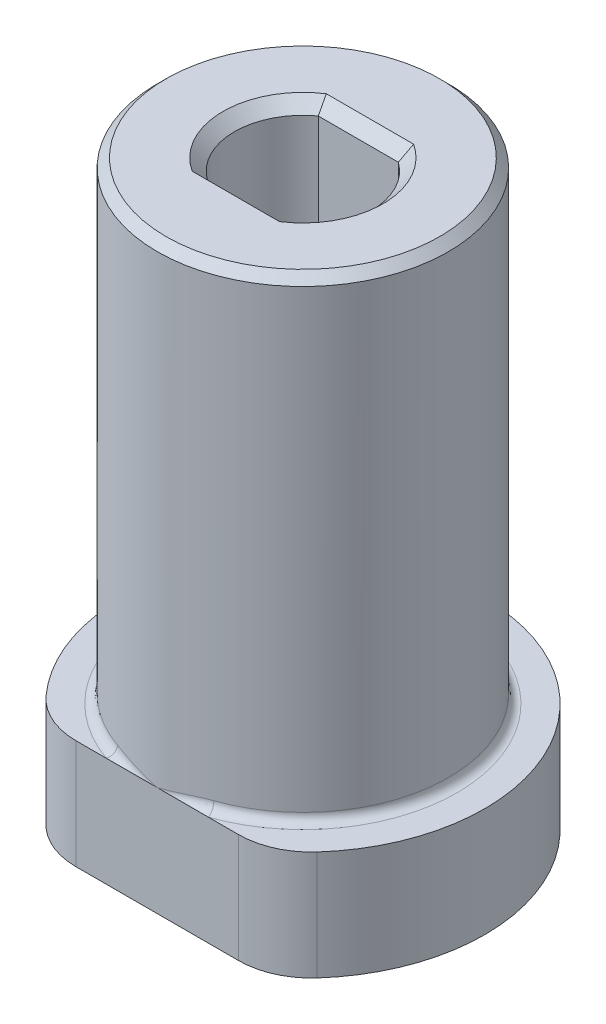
ISO-10303-21;
HEADER;
FILE_DESCRIPTION(('STEP AP214'),'2;1');
FILE_NAME('part.step','',(''),(''),'','','');
FILE_SCHEMA(('AUTOMOTIVE_DESIGN { 1 0 10303 214 1 1 1 1 }'));
ENDSEC;
DATA;
#1=APPLICATION_CONTEXT('core data for automotive mechanical design processes');
#2=APPLICATION_PROTOCOL_DEFINITION('international standard','automotive_design',2000,#1);
#3=PRODUCT_CONTEXT('',#1,'mechanical');
#4=PRODUCT('Part','Part','',(#3));
#5=PRODUCT_RELATED_PRODUCT_CATEGORY('part','',(#4));
#6=PRODUCT_DEFINITION_FORMATION('','',#4);
#7=PRODUCT_DEFINITION_CONTEXT('part definition',#1,'design');
#8=PRODUCT_DEFINITION('design','',#6,#7);
#9=PRODUCT_DEFINITION_SHAPE('','',#8);
#10=(LENGTH_UNIT() NAMED_UNIT(*) SI_UNIT(.MILLI.,.METRE.));
#11=(NAMED_UNIT(*) PLANE_ANGLE_UNIT() SI_UNIT($,.RADIAN.));
#12=(NAMED_UNIT(*) SI_UNIT($,.STERADIAN.) SOLID_ANGLE_UNIT());
#13=UNCERTAINTY_MEASURE_WITH_UNIT(LENGTH_MEASURE(1.E-05),#10,'distance_accuracy_value','');
#14=(GEOMETRIC_REPRESENTATION_CONTEXT(3) GLOBAL_UNCERTAINTY_ASSIGNED_CONTEXT((#13)) GLOBAL_UNIT_ASSIGNED_CONTEXT((#10,
#11,#12)) REPRESENTATION_CONTEXT('',''));
#15=CARTESIAN_POINT('',(0.,0.,0.));
#16=DIRECTION('',(0.,0.,1.));
#17=DIRECTION('',(1.,0.,0.));
#18=AXIS2_PLACEMENT_3D('',#15,#16,#17);
#19=CARTESIAN_POINT('',(0.,25.4,0.));
#20=DIRECTION('',(0.,-1.,0.));
#21=DIRECTION('',(0.,0.,-1.));
#22=AXIS2_PLACEMENT_3D('',#19,#20,#21);
#23=CYLINDRICAL_SURFACE('',#22,6.35);
#24=CARTESIAN_POINT('',(0.,25.019,0.));
#25=DIRECTION('',(0.,1.,0.));
#26=DIRECTION('',(0.,0.,1.));
#27=AXIS2_PLACEMENT_3D('',#24,#25,#26);
#28=CIRCLE('',#27,6.35);
#29=CARTESIAN_POINT('',(0.,25.019,6.35));
#30=VERTEX_POINT('',#29);
#31=EDGE_CURVE('E12',#30,#30,#28,.F.);
#32=ORIENTED_EDGE('',*,*,#31,.T.);
#33=EDGE_LOOP('',(#32));
#34=FACE_BOUND('',#33,.T.);
#35=CARTESIAN_POINT('',(-2.64079902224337,5.06724114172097,5.77483164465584));
#36=CARTESIAN_POINT('',(-2.5793391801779,4.85068522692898,5.80293689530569));
#37=CARTESIAN_POINT('',(-2.63299473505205,4.74749010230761,5.99770734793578));
#38=CARTESIAN_POINT('',(-2.68665028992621,4.64429497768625,6.19247780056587));
#39=CARTESIAN_POINT('',(-2.79924696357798,4.7625,6.35));
#40=CARTESIAN_POINT('',(-2.6233228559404,5.07359151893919,5.78282381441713));
#41=CARTESIAN_POINT('',(-2.56624090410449,4.85864058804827,5.80870378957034));
#42=CARTESIAN_POINT('',(-2.61912385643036,4.75403643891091,5.999442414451));
#43=CARTESIAN_POINT('',(-2.67210495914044,4.64938753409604,6.19016685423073));
#44=CARTESIAN_POINT('',(-2.7807222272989,4.7625,6.35));
#45=CARTESIAN_POINT('',(-2.605671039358,5.0793912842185,5.79079954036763));
#46=CARTESIAN_POINT('',(-2.55251150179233,4.86622995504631,5.81470706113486));
#47=CARTESIAN_POINT('',(-2.60469134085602,4.76037925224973,6.00152016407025));
#48=CARTESIAN_POINT('',(-2.65696733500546,4.65448930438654,6.18831767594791));
#49=CARTESIAN_POINT('',(-2.76201130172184,4.7625,6.35));
#50=CARTESIAN_POINT('',(-2.57008833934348,5.09001659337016,5.80667927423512));
#51=CARTESIAN_POINT('',(-2.52410761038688,4.88062521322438,5.82701755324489));
#52=CARTESIAN_POINT('',(-2.5749205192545,4.77261497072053,6.00621849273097));
#53=CARTESIAN_POINT('',(-2.62582765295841,4.66456572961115,6.18540497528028));
#54=CARTESIAN_POINT('',(-2.72429363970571,4.7625,6.35));
#55=CARTESIAN_POINT('',(-2.55215762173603,5.09484269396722,5.81458332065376));
#56=CARTESIAN_POINT('',(-2.50943374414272,4.88743952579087,5.83332523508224));
#57=CARTESIAN_POINT('',(-2.55958273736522,4.7785081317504,6.00883875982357));
#58=CARTESIAN_POINT('',(-2.6098250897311,4.66954336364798,6.18433540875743));
#59=CARTESIAN_POINT('',(-2.70528707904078,4.7625,6.35));
#60=CARTESIAN_POINT('',(-2.49811443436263,5.10803879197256,5.83810455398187));
#61=CARTESIAN_POINT('',(-2.4645099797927,4.90665701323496,5.85243943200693));
#62=CARTESIAN_POINT('',(-2.51259016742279,4.79543183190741,6.01728947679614));
#63=CARTESIAN_POINT('',(-2.56103864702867,4.68407352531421,6.18207346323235));
#64=CARTESIAN_POINT('',(-2.64800130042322,4.7625,6.35));
#65=CARTESIAN_POINT('',(-2.46166368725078,5.11515676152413,5.85357078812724));
#66=CARTESIAN_POINT('',(-2.43301723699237,4.91802807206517,5.86558774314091));
#67=CARTESIAN_POINT('',(-2.47988531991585,4.80573941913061,6.02371984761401));
#68=CARTESIAN_POINT('',(-2.52710010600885,4.69335401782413,6.18178137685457));
#69=CARTESIAN_POINT('',(-2.6093635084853,4.7625,6.35));
#70=CARTESIAN_POINT('',(-2.38847508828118,5.12670219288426,5.88381196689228));
#71=CARTESIAN_POINT('',(-2.36838343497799,4.93800653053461,5.89193648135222));
#72=CARTESIAN_POINT('',(-2.41293131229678,4.82439155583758,6.03742606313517));
#73=CARTESIAN_POINT('',(-2.45781822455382,4.71068229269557,6.18284584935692));
#74=CARTESIAN_POINT('',(-2.53178359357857,4.7625,6.35));
#75=CARTESIAN_POINT('',(-2.35174199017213,5.13115108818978,5.89859151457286));
#76=CARTESIAN_POINT('',(-2.33524096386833,4.94667356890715,5.90514869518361));
#77=CARTESIAN_POINT('',(-2.3786968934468,4.83275140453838,6.04469459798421));
#78=CARTESIAN_POINT('',(-2.42246682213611,4.7187607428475,6.18417310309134));
#79=CARTESIAN_POINT('',(-2.4928465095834,4.7625,6.35));
#80=CARTESIAN_POINT('',(-2.27782984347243,5.1379218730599,5.9275263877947));
#81=CARTESIAN_POINT('',(-2.26760356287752,4.96174071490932,5.93143301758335));
#82=CARTESIAN_POINT('',(-2.30893967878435,4.84778638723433,6.05971545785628));
#83=CARTESIAN_POINT('',(-2.3505869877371,4.73376580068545,6.18793067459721));
#84=CARTESIAN_POINT('',(-2.41449963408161,4.7625,6.35));
#85=CARTESIAN_POINT('',(-2.24065045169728,5.14024200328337,5.94168118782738));
#86=CARTESIAN_POINT('',(-2.23308549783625,4.96816670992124,5.94451949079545));
#87=CARTESIAN_POINT('',(-2.27341584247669,4.85446012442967,6.067468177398));
#88=CARTESIAN_POINT('',(-2.31403186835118,4.74070926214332,6.1903539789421));
#89=CARTESIAN_POINT('',(-2.37508947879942,4.7625,6.35));
#90=CARTESIAN_POINT('',(-2.11485259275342,5.14509343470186,5.98822036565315));
#91=CARTESIAN_POINT('',(-2.11581483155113,4.98642723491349,5.98777192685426));
#92=CARTESIAN_POINT('',(-2.1521986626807,4.87440421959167,6.09389828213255));
#93=CARTESIAN_POINT('',(-2.19017422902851,4.76211293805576,6.19967896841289));
#94=CARTESIAN_POINT('',(-2.2417437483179,4.7625,6.35));
#95=CARTESIAN_POINT('',(-2.02550531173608,5.14356417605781,6.01902813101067));
#96=CARTESIAN_POINT('',(-2.03001882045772,4.99403630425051,6.01747175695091));
#97=CARTESIAN_POINT('',(-2.06441104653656,4.88419511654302,6.11299941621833));
#98=CARTESIAN_POINT('',(-2.10009644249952,4.7742520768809,6.20825988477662));
#99=CARTESIAN_POINT('',(-2.14703563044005,4.7625,6.35));
#100=CARTESIAN_POINT('',(-1.84584346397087,5.13371963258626,6.07653546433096));
#101=CARTESIAN_POINT('',(-1.85577767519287,5.00136043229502,6.07346602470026));
#102=CARTESIAN_POINT('',(-1.88616403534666,4.89739363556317,6.15017194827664));
#103=CARTESIAN_POINT('',(-1.91782444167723,4.79333851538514,6.22660971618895));
#104=CARTESIAN_POINT('',(-1.95659407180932,4.7625,6.35));
#105=CARTESIAN_POINT('',(-1.75552822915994,5.12539931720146,6.10323196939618));
#106=CARTESIAN_POINT('',(-1.7670774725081,5.00119418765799,6.09989984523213));
#107=CARTESIAN_POINT('',(-1.7957027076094,4.90079651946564,6.16824257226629));
#108=CARTESIAN_POINT('',(-1.82535457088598,4.80038769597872,6.23639323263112));
#109=CARTESIAN_POINT('',(-1.8608599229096,4.7625,6.35));
#110=CARTESIAN_POINT('',(-1.57362316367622,5.10374807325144,6.1526544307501));
#111=CARTESIAN_POINT('',(-1.58744962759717,4.99509068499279,6.14909134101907));
#112=CARTESIAN_POINT('',(-1.61247376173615,4.90277946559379,6.20254660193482));
#113=CARTESIAN_POINT('',(-1.63852691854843,4.81045715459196,6.25580907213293));
#114=CARTESIAN_POINT('',(-1.66804055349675,4.7625,6.35));
#115=CARTESIAN_POINT('',(-1.48202885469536,5.09037997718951,6.17534905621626));
#116=CARTESIAN_POINT('',(-1.49628421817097,4.9891665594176,6.17193009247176));
#117=CARTESIAN_POINT('',(-1.51969392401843,4.90132310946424,6.21876518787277));
#118=CARTESIAN_POINT('',(-1.54392024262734,4.81350623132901,6.26546855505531));
#119=CARTESIAN_POINT('',(-1.57095058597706,4.7625,6.35));
#120=CARTESIAN_POINT('',(-1.29843010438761,5.05997094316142,6.21654539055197));
#121=CARTESIAN_POINT('',(-1.3129663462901,4.9730373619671,6.21350226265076));
#122=CARTESIAN_POINT('',(-1.33307050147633,4.89471302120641,6.24868289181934));
#123=CARTESIAN_POINT('',(-1.3539802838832,4.81641954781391,6.28373518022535));
#124=CARTESIAN_POINT('',(-1.37633591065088,4.7625,6.35));
#125=CARTESIAN_POINT('',(-1.20642553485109,5.0429287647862,6.23504567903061));
#126=CARTESIAN_POINT('',(-1.2206222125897,4.96285019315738,6.23231503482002));
#127=CARTESIAN_POINT('',(-1.23922656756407,4.88955803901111,6.26238115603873));
#128=CARTESIAN_POINT('',(-1.25844595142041,4.81631336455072,6.29237096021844));
#129=CARTESIAN_POINT('',(-1.27881106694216,4.7625,6.35));
#130=CARTESIAN_POINT('',(-0.93143973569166,4.98811726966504,6.28406074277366));
#131=CARTESIAN_POINT('',(-0.945044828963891,4.92795748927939,6.2820290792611));
#132=CARTESIAN_POINT('',(-0.95813022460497,4.87012373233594,6.29903191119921));
#133=CARTESIAN_POINT('',(-0.97364970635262,4.81244851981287,6.31570976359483));
#134=CARTESIAN_POINT('',(-0.987326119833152,4.7625,6.35));
#135=CARTESIAN_POINT('',(-0.74804435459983,4.94645689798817,6.30847855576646));
#136=CARTESIAN_POINT('',(-0.75905650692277,4.89858900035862,6.30725366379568));
#137=CARTESIAN_POINT('',(-0.769852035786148,4.85185765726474,6.31782263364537));
#138=CARTESIAN_POINT('',(-0.781830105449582,4.80524353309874,6.32830982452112));
#139=CARTESIAN_POINT('',(-0.79292701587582,4.7625,6.35));
#140=CARTESIAN_POINT('',(-0.381426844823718,4.85863306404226,6.34119713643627));
#141=CARTESIAN_POINT('',(-0.38769428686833,4.83467802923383,6.34087771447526));
#142=CARTESIAN_POINT('',(-0.392861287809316,4.81053380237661,6.34311097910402));
#143=CARTESIAN_POINT('',(-0.399157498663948,4.7865256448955,6.34527092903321));
#144=CARTESIAN_POINT('',(-0.404312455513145,4.7625,6.35));
#145=CARTESIAN_POINT('',(-0.198205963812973,4.81248407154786,6.34954800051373));
#146=CARTESIAN_POINT('',(-0.201193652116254,4.79999014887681,6.34953328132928));
#147=CARTESIAN_POINT('',(-0.204151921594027,4.78749116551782,6.34964681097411));
#148=CARTESIAN_POINT('',(-0.207140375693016,4.77499581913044,6.34975887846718));
#149=CARTESIAN_POINT('',(-0.210098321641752,4.7625,6.35));
#150=CARTESIAN_POINT('',(-0.0100395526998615,4.76503187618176,6.34999404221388));
#151=CARTESIAN_POINT('',(-0.0101901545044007,4.76439890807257,6.34999389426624));
#152=CARTESIAN_POINT('',(-0.0103407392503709,4.76376593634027,6.34999537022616));
#153=CARTESIAN_POINT('',(-0.0104913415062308,4.76313296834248,6.34999688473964));
#154=CARTESIAN_POINT('',(-0.0106419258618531,4.7625,6.35));
#155=CARTESIAN_POINT('',(-0.00501974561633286,4.7637659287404,6.34999999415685));
#156=CARTESIAN_POINT('',(-0.00509503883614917,4.76344944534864,6.35000002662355));
#157=CARTESIAN_POINT('',(-0.00517033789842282,4.76313296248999,6.3500000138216));
#158=CARTESIAN_POINT('',(-0.00524563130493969,4.76281648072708,6.35000004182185));
#159=CARTESIAN_POINT('',(-0.00532093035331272,4.7625,6.35));
#160=CARTESIAN_POINT('',(0.,4.7625,6.35));
#161=CARTESIAN_POINT('',(0.,4.7625,6.35));
#162=CARTESIAN_POINT('',(0.,4.7625,6.35));
#163=CARTESIAN_POINT('',(0.,4.7625,6.35));
#164=CARTESIAN_POINT('',(0.,4.7625,6.35));
#165=(BOUNDED_SURFACE() B_SPLINE_SURFACE(3,2,((#35,#36,#37,#38,#39),(#40,#41,#42,#43,#44),(#45,
#46,#47,#48,#49),(#50,#51,#52,#53,#54),(#55,#56,#57,#58,#59),(#60,#61,#62,#63,#64),(#65,#66,#67,
#68,#69),(#70,#71,#72,#73,#74),(#75,#76,#77,#78,#79),(#80,#81,#82,#83,#84),(#85,#86,#87,#88,
#89),(#90,#91,#92,#93,#94),(#95,#96,#97,#98,#99),(#100,#101,#102,#103,#104),(#105,#106,#107,
#108,#109),(#110,#111,#112,#113,#114),(#115,#116,#117,#118,#119),(#120,#121,#122,#123,#124),
(#125,#126,#127,#128,#129),(#130,#131,#132,#133,#134),(#135,#136,#137,#138,#139),(#140,#141,
#142,#143,#144),(#145,#146,#147,#148,#149),(#150,#151,#152,#153,#154),(#155,#156,#157,#158,
#159),(#160,#161,#162,#163,#164)),.UNSPECIFIED.,.F.,.F.,.F.) B_SPLINE_SURFACE_WITH_KNOTS((4,2,2,
2,2,2,2,2,2,2,2,2,4),(3,2,3),(0.,0.0639886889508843,0.127940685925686,0.255527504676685,
0.382075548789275,0.508728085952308,0.808795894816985,1.10908618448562,1.41163208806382,
1.71428029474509,2.31481126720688,2.91346674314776,2.92987528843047),(0.,0.5,1.),
.UNSPECIFIED.) GEOMETRIC_REPRESENTATION_ITEM() RATIONAL_B_SPLINE_SURFACE(((1.,0.859223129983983,
1.,0.859223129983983,1.),(1.,0.862193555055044,1.,0.862193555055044,1.),(1.,0.865061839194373,
1.,0.865061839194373,1.),(1.,0.870611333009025,1.,0.870611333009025,1.),(1.,0.873292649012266,
1.,0.873292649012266,1.),(1.,0.881073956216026,1.,0.881073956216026,1.),(1.,0.8859258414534,1.,
0.8859258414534,1.),(1.,0.895045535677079,1.,0.895045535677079,1.),(1.,0.899317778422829,1.,
0.899317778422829,1.),(1.,0.907413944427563,1.,0.907413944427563,1.),(1.,0.911237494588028,1.,
0.911237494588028,1.),(1.,0.923477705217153,1.,0.923477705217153,1.),(1.,0.931015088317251,1.,
0.931015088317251,1.),(1.,0.944520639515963,1.,0.944520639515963,1.),(1.,0.950487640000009,1.,
0.950487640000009,1.),(1.,0.96121129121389,1.,0.96121129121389,1.),(1.,0.965958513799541,1.,
0.965958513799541,1.),(1.,0.974391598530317,1.,0.974391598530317,1.),(1.,0.978077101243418,1.,
0.978077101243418,1.),(1.,0.98770179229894,1.,0.98770179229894,1.),(1.,0.992288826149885,1.,
0.992288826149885,1.),(1.,0.998391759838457,1.,0.998391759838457,1.),(1.,0.999917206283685,1.,
0.999917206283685,1.),(1.,0.999998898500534,1.,0.999998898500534,1.),(1.,0.999999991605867,1.,
0.999999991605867,1.),(1.,1.,1.,1.,1.))) REPRESENTATION_ITEM('') SURFACE());
#166=CARTESIAN_POINT('',(-2.64079902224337,5.06724114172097,5.77483164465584));
#167=CARTESIAN_POINT('',(-2.6233228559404,5.07359151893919,5.78282381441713));
#168=CARTESIAN_POINT('',(-2.605671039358,5.0793912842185,5.79079954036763));
#169=CARTESIAN_POINT('',(-2.57008833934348,5.09001659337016,5.80667927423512));
#170=CARTESIAN_POINT('',(-2.55215762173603,5.09484269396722,5.81458332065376));
#171=CARTESIAN_POINT('',(-2.49811443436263,5.10803879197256,5.83810455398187));
#172=CARTESIAN_POINT('',(-2.46166368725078,5.11515676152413,5.85357078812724));
#173=CARTESIAN_POINT('',(-2.38847508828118,5.12670219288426,5.88381196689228));
#174=CARTESIAN_POINT('',(-2.35174199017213,5.13115108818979,5.89859151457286));
#175=CARTESIAN_POINT('',(-2.27782984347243,5.1379218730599,5.9275263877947));
#176=CARTESIAN_POINT('',(-2.24065045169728,5.14024200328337,5.94168118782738));
#177=CARTESIAN_POINT('',(-2.11485259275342,5.14509343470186,5.98822036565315));
#178=CARTESIAN_POINT('',(-2.02550531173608,5.14356417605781,6.01902813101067));
#179=CARTESIAN_POINT('',(-1.84584346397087,5.13371963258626,6.07653546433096));
#180=CARTESIAN_POINT('',(-1.75552822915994,5.12539931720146,6.10323196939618));
#181=CARTESIAN_POINT('',(-1.57362316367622,5.10374807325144,6.1526544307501));
#182=CARTESIAN_POINT('',(-1.48202885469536,5.09037997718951,6.17534905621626));
#183=CARTESIAN_POINT('',(-1.29843010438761,5.05997094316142,6.21654539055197));
#184=CARTESIAN_POINT('',(-1.20642553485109,5.0429287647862,6.23504567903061));
#185=CARTESIAN_POINT('',(-0.93143973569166,4.98811726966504,6.28406074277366));
#186=CARTESIAN_POINT('',(-0.748044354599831,4.94645689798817,6.30847855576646));
#187=CARTESIAN_POINT('',(-0.381426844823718,4.85863306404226,6.34119713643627));
#188=CARTESIAN_POINT('',(-0.198205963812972,4.81248407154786,6.34954800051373));
#189=CARTESIAN_POINT('',(-0.0100395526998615,4.76503187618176,6.34999404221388));
#190=CARTESIAN_POINT('',(-0.00501974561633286,4.7637659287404,6.34999999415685));
#191=CARTESIAN_POINT('',(0.,4.7625,6.35));
#192=B_SPLINE_CURVE_WITH_KNOTS('',3,(#166,#167,#168,#169,#170,#171,#172,#173,#174,#175,#176,
#177,#178,#179,#180,#181,#182,#183,#184,#185,#186,#187,#188,#189,#190,#191),.UNSPECIFIED.,.F.,
.F.,(4,2,2,2,2,2,2,2,2,2,2,2,4),(0.,0.0639886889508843,0.127940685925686,0.255527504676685,
0.382075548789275,0.508728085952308,0.808795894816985,1.10908618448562,1.41163208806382,
1.71428029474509,2.31481126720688,2.91346674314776,2.92987528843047),.UNSPECIFIED.);
#193=CARTESIAN_POINT('',(-2.10609082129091,5.1435,5.99056603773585));
#194=VERTEX_POINT('',#193);
#195=CARTESIAN_POINT('',(0.,4.7625,6.35));
#196=VERTEX_POINT('',#195);
#197=EDGE_CURVE('E140',#194,#196,#192,.T.);
#198=ORIENTED_EDGE('',*,*,#197,.T.);
#199=CARTESIAN_POINT('',(2.79924696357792,4.7625,6.35));
#200=CARTESIAN_POINT('',(2.68665028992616,4.64429497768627,6.19247780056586));
#201=CARTESIAN_POINT('',(2.63299473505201,4.74749010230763,5.99770734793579));
#202=CARTESIAN_POINT('',(2.57933918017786,4.850685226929,5.80293689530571));
#203=CARTESIAN_POINT('',(2.64079902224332,5.06724114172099,5.77483164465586));
#204=CARTESIAN_POINT('',(2.78072222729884,4.7625,6.35));
#205=CARTESIAN_POINT('',(2.6721049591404,4.64938753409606,6.19016685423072));
#206=CARTESIAN_POINT('',(2.61912385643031,4.75403643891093,5.99944241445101));
#207=CARTESIAN_POINT('',(2.56624090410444,4.85864058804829,5.80870378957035));
#208=CARTESIAN_POINT('',(2.62332285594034,5.07359151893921,5.78282381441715));
#209=CARTESIAN_POINT('',(2.76201130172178,4.7625,6.35));
#210=CARTESIAN_POINT('',(2.65696733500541,4.65448930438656,6.1883176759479));
#211=CARTESIAN_POINT('',(2.60469134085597,4.76037925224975,6.00152016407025));
#212=CARTESIAN_POINT('',(2.55251150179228,4.86622995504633,5.81470706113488));
#213=CARTESIAN_POINT('',(2.60567103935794,5.07939128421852,5.79079954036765));
#214=CARTESIAN_POINT('',(2.72429363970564,4.7625,6.35));
#215=CARTESIAN_POINT('',(2.62582765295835,4.66456572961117,6.18540497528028));
#216=CARTESIAN_POINT('',(2.57492051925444,4.77261497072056,6.00621849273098));
#217=CARTESIAN_POINT('',(2.52410761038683,4.8806252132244,5.82701755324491));
#218=CARTESIAN_POINT('',(2.57008833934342,5.09001659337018,5.80667927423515));
#219=CARTESIAN_POINT('',(2.7052870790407,4.7625,6.35));
#220=CARTESIAN_POINT('',(2.60982508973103,4.66954336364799,6.18433540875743));
#221=CARTESIAN_POINT('',(2.55958273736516,4.77850813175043,6.00883875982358));
#222=CARTESIAN_POINT('',(2.50943374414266,4.88743952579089,5.83332523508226));
#223=CARTESIAN_POINT('',(2.55215762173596,5.09484269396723,5.81458332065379));
#224=CARTESIAN_POINT('',(2.64800130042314,4.7625,6.35));
#225=CARTESIAN_POINT('',(2.5610386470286,4.68407352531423,6.18207346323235));
#226=CARTESIAN_POINT('',(2.51259016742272,4.79543183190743,6.01728947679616));
#227=CARTESIAN_POINT('',(2.46450997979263,4.90665701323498,5.85243943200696));
#228=CARTESIAN_POINT('',(2.49811443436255,5.10803879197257,5.8381045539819));
#229=CARTESIAN_POINT('',(2.60936350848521,4.7625,6.35));
#230=CARTESIAN_POINT('',(2.52710010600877,4.69335401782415,6.18178137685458));
#231=CARTESIAN_POINT('',(2.47988531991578,4.80573941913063,6.02371984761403));
#232=CARTESIAN_POINT('',(2.43301723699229,4.91802807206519,5.86558774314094));
#233=CARTESIAN_POINT('',(2.46166368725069,5.11515676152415,5.85357078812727));
#234=CARTESIAN_POINT('',(2.53178359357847,4.7625,6.35));
#235=CARTESIAN_POINT('',(2.45781822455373,4.71068229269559,6.18284584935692));
#236=CARTESIAN_POINT('',(2.41293131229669,4.8243915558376,6.03742606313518));
#237=CARTESIAN_POINT('',(2.3683834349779,4.93800653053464,5.89193648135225));
#238=CARTESIAN_POINT('',(2.38847508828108,5.12670219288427,5.88381196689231));
#239=CARTESIAN_POINT('',(2.49284650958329,4.7625,6.35));
#240=CARTESIAN_POINT('',(2.42246682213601,4.71876074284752,6.18417310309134));
#241=CARTESIAN_POINT('',(2.3786968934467,4.83275140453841,6.04469459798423));
#242=CARTESIAN_POINT('',(2.33524096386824,4.94667356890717,5.90514869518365));
#243=CARTESIAN_POINT('',(2.35174199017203,5.1311510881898,5.8985915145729));
#244=CARTESIAN_POINT('',(2.41449963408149,4.7625,6.35));
#245=CARTESIAN_POINT('',(2.35058698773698,4.73376580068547,6.18793067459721));
#246=CARTESIAN_POINT('',(2.30893967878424,4.84778638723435,6.05971545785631));
#247=CARTESIAN_POINT('',(2.26760356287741,4.96174071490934,5.93143301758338));
#248=CARTESIAN_POINT('',(2.27782984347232,5.1379218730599,5.92752638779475));
#249=CARTESIAN_POINT('',(2.37508947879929,4.7625,6.35));
#250=CARTESIAN_POINT('',(2.31403186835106,4.74070926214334,6.19035397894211));
#251=CARTESIAN_POINT('',(2.27341584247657,4.85446012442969,6.06746817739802));
#252=CARTESIAN_POINT('',(2.23308549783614,4.96816670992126,5.9445194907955));
#253=CARTESIAN_POINT('',(2.24065045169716,5.14024200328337,5.94168118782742));
#254=CARTESIAN_POINT('',(2.24174374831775,4.7625,6.35));
#255=CARTESIAN_POINT('',(2.19017422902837,4.76211293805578,6.19967896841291));
#256=CARTESIAN_POINT('',(2.15219866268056,4.87440421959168,6.09389828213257));
#257=CARTESIAN_POINT('',(2.11581483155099,4.9864272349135,5.98777192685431));
#258=CARTESIAN_POINT('',(2.11485259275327,5.14509343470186,5.9882203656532));
#259=CARTESIAN_POINT('',(2.14703563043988,4.7625,6.35));
#260=CARTESIAN_POINT('',(2.10009644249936,4.77425207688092,6.20825988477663));
#261=CARTESIAN_POINT('',(2.06441104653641,4.88419511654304,6.11299941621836));
#262=CARTESIAN_POINT('',(2.03001882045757,4.99403630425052,6.01747175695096));
#263=CARTESIAN_POINT('',(2.02550531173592,5.14356417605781,6.01902813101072));
#264=CARTESIAN_POINT('',(1.95659407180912,4.7625,6.35));
#265=CARTESIAN_POINT('',(1.91782444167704,4.79333851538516,6.22660971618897));
#266=CARTESIAN_POINT('',(1.88616403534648,4.89739363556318,6.15017194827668));
#267=CARTESIAN_POINT('',(1.85577767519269,5.00136043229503,6.07346602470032));
#268=CARTESIAN_POINT('',(1.84584346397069,5.13371963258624,6.07653546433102));
#269=CARTESIAN_POINT('',(1.86085992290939,4.7625,6.35));
#270=CARTESIAN_POINT('',(1.82535457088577,4.80038769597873,6.23639323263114));
#271=CARTESIAN_POINT('',(1.7957027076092,4.90079651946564,6.16824257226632));
#272=CARTESIAN_POINT('',(1.76707747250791,5.00119418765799,6.09989984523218));
#273=CARTESIAN_POINT('',(1.75552822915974,5.12539931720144,6.10323196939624));
#274=CARTESIAN_POINT('',(1.66804055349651,4.7625,6.35));
#275=CARTESIAN_POINT('',(1.6385269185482,4.81045715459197,6.25580907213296));
#276=CARTESIAN_POINT('',(1.61247376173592,4.90277946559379,6.20254660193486));
#277=CARTESIAN_POINT('',(1.58744962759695,4.99509068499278,6.14909134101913));
#278=CARTESIAN_POINT('',(1.573623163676,5.10374807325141,6.15265443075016));
#279=CARTESIAN_POINT('',(1.57095058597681,4.7625,6.35));
#280=CARTESIAN_POINT('',(1.54392024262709,4.81350623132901,6.26546855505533));
#281=CARTESIAN_POINT('',(1.51969392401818,4.90132310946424,6.21876518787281));
#282=CARTESIAN_POINT('',(1.49628421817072,4.98916655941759,6.17193009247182));
#283=CARTESIAN_POINT('',(1.48202885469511,5.09037997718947,6.17534905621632));
#284=CARTESIAN_POINT('',(1.37633591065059,4.7625,6.35));
#285=CARTESIAN_POINT('',(1.35398028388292,4.81641954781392,6.28373518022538));
#286=CARTESIAN_POINT('',(1.33307050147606,4.8947130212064,6.24868289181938));
#287=CARTESIAN_POINT('',(1.31296634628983,4.97303736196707,6.21350226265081));
#288=CARTESIAN_POINT('',(1.29843010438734,5.05997094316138,6.21654539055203));
#289=CARTESIAN_POINT('',(1.27881106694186,4.7625,6.35));
#290=CARTESIAN_POINT('',(1.25844595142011,4.81631336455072,6.29237096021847));
#291=CARTESIAN_POINT('',(1.23922656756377,4.88955803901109,6.26238115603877));
#292=CARTESIAN_POINT('',(1.22062221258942,4.96285019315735,6.23231503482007));
#293=CARTESIAN_POINT('',(1.20642553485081,5.04292876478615,6.23504567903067));
#294=CARTESIAN_POINT('',(0.987326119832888,4.7625,6.35));
#295=CARTESIAN_POINT('',(0.973649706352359,4.81244851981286,6.31570976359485));
#296=CARTESIAN_POINT('',(0.958130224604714,4.87012373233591,6.29903191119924));
#297=CARTESIAN_POINT('',(0.945044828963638,4.92795748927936,6.28202907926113));
#298=CARTESIAN_POINT('',(0.931439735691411,4.98811726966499,6.2840607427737));
#299=CARTESIAN_POINT('',(0.792927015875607,4.7625,6.35));
#300=CARTESIAN_POINT('',(0.781830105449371,4.80524353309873,6.32830982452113));
#301=CARTESIAN_POINT('',(0.769852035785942,4.85185765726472,6.31782263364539));
#302=CARTESIAN_POINT('',(0.759056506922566,4.89858900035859,6.3072536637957));
#303=CARTESIAN_POINT('',(0.748044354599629,4.94645689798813,6.30847855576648));
#304=CARTESIAN_POINT('',(0.40431245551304,4.7625,6.35));
#305=CARTESIAN_POINT('',(0.399157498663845,4.78652564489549,6.34527092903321));
#306=CARTESIAN_POINT('',(0.392861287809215,4.8105338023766,6.34311097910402));
#307=CARTESIAN_POINT('',(0.38769428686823,4.83467802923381,6.34087771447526));
#308=CARTESIAN_POINT('',(0.381426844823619,4.85863306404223,6.34119713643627));
#309=CARTESIAN_POINT('',(0.210098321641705,4.7625,6.35));
#310=CARTESIAN_POINT('',(0.20714037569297,4.77499581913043,6.34975887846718));
#311=CARTESIAN_POINT('',(0.204151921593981,4.7874911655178,6.34964681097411));
#312=CARTESIAN_POINT('',(0.201193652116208,4.79999014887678,6.34953328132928));
#313=CARTESIAN_POINT('',(0.198205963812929,4.81248407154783,6.34954800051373));
#314=CARTESIAN_POINT('',(0.0106419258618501,4.7625,6.35));
#315=CARTESIAN_POINT('',(0.0104913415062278,4.76313296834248,6.34999688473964));
#316=CARTESIAN_POINT('',(0.0103407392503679,4.76376593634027,6.34999537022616));
#317=CARTESIAN_POINT('',(0.0101901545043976,4.76439890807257,6.34999389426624));
#318=CARTESIAN_POINT('',(0.0100395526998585,4.76503187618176,6.34999404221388));
#319=CARTESIAN_POINT('',(0.00532093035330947,4.7625,6.35));
#320=CARTESIAN_POINT('',(0.00524563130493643,4.76281648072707,6.35000004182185));
#321=CARTESIAN_POINT('',(0.00517033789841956,4.76313296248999,6.3500000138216));
#322=CARTESIAN_POINT('',(0.00509503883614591,4.76344944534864,6.35000002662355));
#323=CARTESIAN_POINT('',(0.0050197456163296,4.7637659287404,6.34999999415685));
#324=CARTESIAN_POINT('',(0.,4.7625,6.35));
#325=CARTESIAN_POINT('',(0.,4.7625,6.35));
#326=CARTESIAN_POINT('',(0.,4.7625,6.35));
#327=CARTESIAN_POINT('',(0.,4.7625,6.35));
#328=CARTESIAN_POINT('',(0.,4.7625,6.35));
#329=(BOUNDED_SURFACE() B_SPLINE_SURFACE(3,2,((#199,#200,#201,#202,#203),(#204,#205,#206,#207,
#208),(#209,#210,#211,#212,#213),(#214,#215,#216,#217,#218),(#219,#220,#221,#222,#223),(#224,
#225,#226,#227,#228),(#229,#230,#231,#232,#233),(#234,#235,#236,#237,#238),(#239,#240,#241,#242,
#243),(#244,#245,#246,#247,#248),(#249,#250,#251,#252,#253),(#254,#255,#256,#257,#258),(#259,
#260,#261,#262,#263),(#264,#265,#266,#267,#268),(#269,#270,#271,#272,#273),(#274,#275,#276,#277,
#278),(#279,#280,#281,#282,#283),(#284,#285,#286,#287,#288),(#289,#290,#291,#292,#293),(#294,
#295,#296,#297,#298),(#299,#300,#301,#302,#303),(#304,#305,#306,#307,#308),(#309,#310,#311,#312,
#313),(#314,#315,#316,#317,#318),(#319,#320,#321,#322,#323),(#324,#325,#326,#327,#328)),
.UNSPECIFIED.,.F.,.F.,.F.) B_SPLINE_SURFACE_WITH_KNOTS((4,2,2,2,2,2,2,2,2,2,2,2,4),(3,2,3),(0.,
0.0639886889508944,0.127940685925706,0.255527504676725,0.382075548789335,0.508728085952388,
0.80879589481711,1.1090861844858,1.41163208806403,1.71428029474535,2.31481126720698,
2.9134667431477,2.92987528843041),(0.,0.5,1.),
.UNSPECIFIED.) GEOMETRIC_REPRESENTATION_ITEM() RATIONAL_B_SPLINE_SURFACE(((1.,0.859223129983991,
1.,0.859223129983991,1.),(1.,0.862193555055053,1.,0.862193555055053,1.),(1.,0.865061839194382,
1.,0.865061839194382,1.),(1.,0.870611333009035,1.,0.870611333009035,1.),(1.,0.873292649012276,
1.,0.873292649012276,1.),(1.,0.881073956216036,1.,0.881073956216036,1.),(1.,0.885925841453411,
1.,0.885925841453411,1.),(1.,0.89504553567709,1.,0.89504553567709,1.),(1.,0.89931777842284,1.,
0.89931777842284,1.),(1.,0.907413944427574,1.,0.907413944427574,1.),(1.,0.91123749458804,1.,
0.91123749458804,1.),(1.,0.923477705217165,1.,0.923477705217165,1.),(1.,0.931015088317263,1.,
0.931015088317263,1.),(1.,0.944520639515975,1.,0.944520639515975,1.),(1.,0.950487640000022,1.,
0.950487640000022,1.),(1.,0.961211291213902,1.,0.961211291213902,1.),(1.,0.965958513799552,1.,
0.965958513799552,1.),(1.,0.974391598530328,1.,0.974391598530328,1.),(1.,0.978077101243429,1.,
0.978077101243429,1.),(1.,0.987701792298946,1.,0.987701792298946,1.),(1.,0.992288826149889,1.,
0.992288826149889,1.),(1.,0.998391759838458,1.,0.998391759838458,1.),(1.,0.999917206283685,1.,
0.999917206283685,1.),(1.,0.999998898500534,1.,0.999998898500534,1.),(1.,0.999999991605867,1.,
0.999999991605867,1.),(1.,1.,1.,1.,1.))) REPRESENTATION_ITEM('') SURFACE());
#330=CARTESIAN_POINT('',(2.64079902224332,5.06724114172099,5.77483164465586));
#331=CARTESIAN_POINT('',(2.62332285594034,5.07359151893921,5.78282381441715));
#332=CARTESIAN_POINT('',(2.60567103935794,5.07939128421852,5.79079954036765));
#333=CARTESIAN_POINT('',(2.57008833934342,5.09001659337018,5.80667927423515));
#334=CARTESIAN_POINT('',(2.55215762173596,5.09484269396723,5.81458332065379));
#335=CARTESIAN_POINT('',(2.49811443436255,5.10803879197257,5.8381045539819));
#336=CARTESIAN_POINT('',(2.46166368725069,5.11515676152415,5.85357078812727));
#337=CARTESIAN_POINT('',(2.38847508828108,5.12670219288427,5.88381196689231));
#338=CARTESIAN_POINT('',(2.35174199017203,5.1311510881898,5.8985915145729));
#339=CARTESIAN_POINT('',(2.27782984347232,5.1379218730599,5.92752638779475));
#340=CARTESIAN_POINT('',(2.24065045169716,5.14024200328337,5.94168118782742));
#341=CARTESIAN_POINT('',(2.11485259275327,5.14509343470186,5.9882203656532));
#342=CARTESIAN_POINT('',(2.02550531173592,5.14356417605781,6.01902813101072));
#343=CARTESIAN_POINT('',(1.84584346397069,5.13371963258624,6.07653546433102));
#344=CARTESIAN_POINT('',(1.75552822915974,5.12539931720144,6.10323196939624));
#345=CARTESIAN_POINT('',(1.573623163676,5.10374807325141,6.15265443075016));
#346=CARTESIAN_POINT('',(1.48202885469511,5.09037997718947,6.17534905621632));
#347=CARTESIAN_POINT('',(1.29843010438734,5.05997094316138,6.21654539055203));
#348=CARTESIAN_POINT('',(1.20642553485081,5.04292876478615,6.23504567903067));
#349=CARTESIAN_POINT('',(0.931439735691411,4.98811726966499,6.2840607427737));
#350=CARTESIAN_POINT('',(0.748044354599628,4.94645689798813,6.30847855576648));
#351=CARTESIAN_POINT('',(0.38142684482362,4.85863306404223,6.34119713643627));
#352=CARTESIAN_POINT('',(0.198205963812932,4.81248407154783,6.34954800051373));
#353=CARTESIAN_POINT('',(0.0100395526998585,4.76503187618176,6.34999404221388));
#354=CARTESIAN_POINT('',(0.0050197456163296,4.7637659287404,6.34999999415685));
#355=CARTESIAN_POINT('',(0.,4.7625,6.35));
#356=B_SPLINE_CURVE_WITH_KNOTS('',3,(#330,#331,#332,#333,#334,#335,#336,#337,#338,#339,#340,
#341,#342,#343,#344,#345,#346,#347,#348,#349,#350,#351,#352,#353,#354,#355),.UNSPECIFIED.,.F.,
.F.,(4,2,2,2,2,2,2,2,2,2,2,2,4),(0.,0.0639886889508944,0.127940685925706,0.255527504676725,
0.382075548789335,0.508728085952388,0.80879589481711,1.1090861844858,1.41163208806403,
1.71428029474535,2.31481126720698,2.9134667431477,2.92987528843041),.UNSPECIFIED.);
#357=CARTESIAN_POINT('',(2.1060908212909,5.1435,5.99056603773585));
#358=VERTEX_POINT('',#357);
#359=EDGE_CURVE('E143',#196,#358,#356,.F.);
#360=ORIENTED_EDGE('',*,*,#359,.T.);
#361=CARTESIAN_POINT('',(0.,5.1435,0.));
#362=DIRECTION('',(0.,-1.,0.));
#363=DIRECTION('',(0.,0.,-1.));
#364=AXIS2_PLACEMENT_3D('',#361,#362,#363);
#365=CIRCLE('',#364,6.35);
#366=EDGE_CURVE('E146',#358,#194,#365,.F.);
#367=ORIENTED_EDGE('',*,*,#366,.T.);
#368=EDGE_LOOP('',(#198,#360,#367));
#369=FACE_BOUND('',#368,.T.);
#370=ADVANCED_FACE('F34',(#34,#369),#23,.T.);
#371=CARTESIAN_POINT('',(0.,25.4,0.));
#372=DIRECTION('',(0.,1.,0.));
#373=DIRECTION('',(0.,0.,1.));
#374=AXIS2_PLACEMENT_3D('',#371,#372,#373);
#375=PLANE('',#374);
#376=CARTESIAN_POINT('',(0.,25.4,0.));
#377=DIRECTION('',(0.,1.,0.));
#378=DIRECTION('',(0.,0.,1.));
#379=AXIS2_PLACEMENT_3D('',#376,#377,#378);
#380=CIRCLE('',#379,5.969);
#381=CARTESIAN_POINT('',(0.,25.4,5.969));
#382=VERTEX_POINT('',#381);
#383=EDGE_CURVE('E42',#382,#382,#380,.T.);
#384=ORIENTED_EDGE('',*,*,#383,.T.);
#385=EDGE_LOOP('',(#384));
#386=FACE_BOUND('',#385,.T.);
#387=DIRECTION('',(1.,0.,0.));
#388=VECTOR('',#387,1.);
#389=CARTESIAN_POINT('',(1.74756568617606,25.4,-2.92735));
#390=LINE('',#389,#388);
#391=CARTESIAN_POINT('',(-1.9047777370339,25.4,-2.92735));
#392=VERTEX_POINT('',#391);
#393=CARTESIAN_POINT('',(1.9047777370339,25.4,-2.92735));
#394=VERTEX_POINT('',#393);
#395=EDGE_CURVE('E387',#392,#394,#390,.T.);
#396=ORIENTED_EDGE('',*,*,#395,.T.);
#397=CARTESIAN_POINT('',(0.,25.4,0.));
#398=DIRECTION('',(0.,1.,0.));
#399=DIRECTION('',(0.,0.,1.));
#400=AXIS2_PLACEMENT_3D('',#397,#398,#399);
#401=CIRCLE('',#400,3.4925);
#402=CARTESIAN_POINT('',(1.9047777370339,25.4,2.92735));
#403=VERTEX_POINT('',#402);
#404=EDGE_CURVE('E380',#394,#403,#401,.F.);
#405=ORIENTED_EDGE('',*,*,#404,.T.);
#406=DIRECTION('',(-1.,0.,0.));
#407=VECTOR('',#406,1.);
#408=CARTESIAN_POINT('',(-1.74756568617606,25.4,2.92735));
#409=LINE('',#408,#407);
#410=CARTESIAN_POINT('',(-1.9047777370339,25.4,2.92735));
#411=VERTEX_POINT('',#410);
#412=EDGE_CURVE('E383',#403,#411,#409,.T.);
#413=ORIENTED_EDGE('',*,*,#412,.T.);
#414=CARTESIAN_POINT('',(0.,25.4,0.));
#415=DIRECTION('',(0.,1.,0.));
#416=DIRECTION('',(0.,0.,1.));
#417=AXIS2_PLACEMENT_3D('',#414,#415,#416);
#418=CIRCLE('',#417,3.4925);
#419=EDGE_CURVE('E385',#411,#392,#418,.F.);
#420=ORIENTED_EDGE('',*,*,#419,.T.);
#421=EDGE_LOOP('',(#396,#405,#413,#420));
#422=FACE_BOUND('',#421,.T.);
#423=ADVANCED_FACE('F346',(#386,#422),#375,.T.);
#424=CARTESIAN_POINT('',(0.,4.7625,0.));
#425=DIRECTION('',(0.,-1.,0.));
#426=DIRECTION('',(0.,0.,-1.));
#427=AXIS2_PLACEMENT_3D('',#424,#425,#426);
#428=PLANE('',#427);
#429=DIRECTION('',(-1.,0.,0.));
#430=VECTOR('',#429,1.);
#431=CARTESIAN_POINT('',(-4.7625,4.7625,6.35));
#432=LINE('',#431,#430);
#433=CARTESIAN_POINT('',(3.54975791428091,4.7625,6.35));
#434=VERTEX_POINT('',#433);
#435=CARTESIAN_POINT('',(2.23245627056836,4.7625,6.35));
#436=VERTEX_POINT('',#435);
#437=EDGE_CURVE('E162',#434,#436,#432,.T.);
#438=ORIENTED_EDGE('',*,*,#437,.F.);
#439=CARTESIAN_POINT('',(3.54975791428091,4.7625,3.175));
#440=DIRECTION('',(0.,-1.,0.));
#441=DIRECTION('',(0.,0.,-1.));
#442=AXIS2_PLACEMENT_3D('',#439,#440,#441);
#443=CIRCLE('',#442,3.175);
#444=CARTESIAN_POINT('',(5.91626319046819,4.7625,5.29166666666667));
#445=VERTEX_POINT('',#444);
#446=EDGE_CURVE('E150',#434,#445,#443,.F.);
#447=ORIENTED_EDGE('',*,*,#446,.T.);
#448=CARTESIAN_POINT('',(0.,4.7625,0.));
#449=DIRECTION('',(0.,-1.,0.));
#450=DIRECTION('',(0.,0.,-1.));
#451=AXIS2_PLACEMENT_3D('',#448,#449,#450);
#452=CIRCLE('',#451,7.9375);
#453=CARTESIAN_POINT('',(-5.91626319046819,4.7625,5.29166666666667));
#454=VERTEX_POINT('',#453);
#455=EDGE_CURVE('E174',#454,#445,#452,.T.);
#456=ORIENTED_EDGE('',*,*,#455,.F.);
#457=CARTESIAN_POINT('',(-3.54975791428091,4.7625,3.175));
#458=DIRECTION('',(0.,-1.,0.));
#459=DIRECTION('',(0.,0.,-1.));
#460=AXIS2_PLACEMENT_3D('',#457,#458,#459);
#461=CIRCLE('',#460,3.175);
#462=CARTESIAN_POINT('',(-3.54975791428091,4.7625,6.35));
#463=VERTEX_POINT('',#462);
#464=EDGE_CURVE('E201',#454,#463,#461,.F.);
#465=ORIENTED_EDGE('',*,*,#464,.T.);
#466=CARTESIAN_POINT('',(-2.23245627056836,4.7625,6.35));
#467=VERTEX_POINT('',#466);
#468=EDGE_CURVE('E166',#467,#463,#432,.T.);
#469=ORIENTED_EDGE('',*,*,#468,.F.);
#470=CARTESIAN_POINT('',(0.,4.7625,0.));
#471=DIRECTION('',(0.,-1.,0.));
#472=DIRECTION('',(0.,0.,-1.));
#473=AXIS2_PLACEMENT_3D('',#470,#471,#472);
#474=CIRCLE('',#473,6.731);
#475=EDGE_CURVE('E199',#467,#436,#474,.T.);
#476=ORIENTED_EDGE('',*,*,#475,.T.);
#477=EDGE_LOOP('',(#438,#447,#456,#465,#469,#476));
#478=FACE_BOUND('',#477,.T.);
#479=ADVANCED_FACE('F351',(#478),#428,.F.);
#480=CARTESIAN_POINT('',(-4.7625,4.7625,6.35));
#481=DIRECTION('',(0.,0.,1.));
#482=DIRECTION('',(1.,0.,0.));
#483=AXIS2_PLACEMENT_3D('',#480,#481,#482);
#484=PLANE('',#483);
#485=DIRECTION('',(-1.,0.,0.));
#486=VECTOR('',#485,1.);
#487=CARTESIAN_POINT('',(-4.7625,0.,6.35));
#488=LINE('',#487,#486);
#489=CARTESIAN_POINT('',(3.54975791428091,0.,6.35));
#490=VERTEX_POINT('',#489);
#491=CARTESIAN_POINT('',(-3.54975791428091,0.,6.35));
#492=VERTEX_POINT('',#491);
#493=EDGE_CURVE('E189',#490,#492,#488,.T.);
#494=ORIENTED_EDGE('',*,*,#493,.F.);
#495=DIRECTION('',(0.,-1.,0.));
#496=VECTOR('',#495,1.);
#497=CARTESIAN_POINT('',(3.54975791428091,4.7625,6.35));
#498=LINE('',#497,#496);
#499=EDGE_CURVE('E197',#490,#434,#498,.F.);
#500=ORIENTED_EDGE('',*,*,#499,.T.);
#501=ORIENTED_EDGE('',*,*,#437,.T.);
#502=EDGE_CURVE('E156',#436,#196,#432,.T.);
#503=ORIENTED_EDGE('',*,*,#502,.T.);
#504=EDGE_CURVE('E160',#196,#467,#432,.T.);
#505=ORIENTED_EDGE('',*,*,#504,.T.);
#506=ORIENTED_EDGE('',*,*,#468,.T.);
#507=DIRECTION('',(0.,-1.,0.));
#508=VECTOR('',#507,1.);
#509=CARTESIAN_POINT('',(-3.54975791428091,4.7625,6.35));
#510=LINE('',#509,#508);
#511=EDGE_CURVE('E194',#463,#492,#510,.T.);
#512=ORIENTED_EDGE('',*,*,#511,.T.);
#513=EDGE_LOOP('',(#494,#500,#501,#503,#505,#506,#512));
#514=FACE_BOUND('',#513,.T.);
#515=ADVANCED_FACE('F158',(#514),#484,.T.);
#516=CARTESIAN_POINT('',(0.,4.7625,0.));
#517=DIRECTION('',(0.,-1.,0.));
#518=DIRECTION('',(0.,0.,-1.));
#519=AXIS2_PLACEMENT_3D('',#516,#517,#518);
#520=CYLINDRICAL_SURFACE('',#519,7.9375);
#521=ORIENTED_EDGE('',*,*,#455,.T.);
#522=DIRECTION('',(0.,-1.,0.));
#523=VECTOR('',#522,1.);
#524=CARTESIAN_POINT('',(5.91626319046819,4.7625,5.29166666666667));
#525=LINE('',#524,#523);
#526=CARTESIAN_POINT('',(5.91626319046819,0.,5.29166666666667));
#527=VERTEX_POINT('',#526);
#528=EDGE_CURVE('E178',#445,#527,#525,.T.);
#529=ORIENTED_EDGE('',*,*,#528,.T.);
#530=CARTESIAN_POINT('',(0.,0.,0.));
#531=DIRECTION('',(0.,-1.,0.));
#532=DIRECTION('',(0.,0.,-1.));
#533=AXIS2_PLACEMENT_3D('',#530,#531,#532);
#534=CIRCLE('',#533,7.9375);
#535=CARTESIAN_POINT('',(-5.91626319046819,0.,5.29166666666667));
#536=VERTEX_POINT('',#535);
#537=EDGE_CURVE('E427',#536,#527,#534,.T.);
#538=ORIENTED_EDGE('',*,*,#537,.F.);
#539=DIRECTION('',(0.,-1.,0.));
#540=VECTOR('',#539,1.);
#541=CARTESIAN_POINT('',(-5.91626319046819,4.7625,5.29166666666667));
#542=LINE('',#541,#540);
#543=EDGE_CURVE('E177',#536,#454,#542,.F.);
#544=ORIENTED_EDGE('',*,*,#543,.T.);
#545=EDGE_LOOP('',(#521,#529,#538,#544));
#546=FACE_BOUND('',#545,.T.);
#547=ADVANCED_FACE('F434',(#546),#520,.T.);
#548=CARTESIAN_POINT('',(0.,0.,0.));
#549=DIRECTION('',(0.,1.,0.));
#550=DIRECTION('',(0.,0.,1.));
#551=AXIS2_PLACEMENT_3D('',#548,#549,#550);
#552=PLANE('',#551);
#553=CARTESIAN_POINT('',(0.,0.,0.));
#554=DIRECTION('',(0.,1.,0.));
#555=DIRECTION('',(0.,0.,1.));
#556=AXIS2_PLACEMENT_3D('',#553,#554,#555);
#557=CIRCLE('',#556,3.4925);
#558=CARTESIAN_POINT('',(-1.9047777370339,0.,-2.92735));
#559=VERTEX_POINT('',#558);
#560=CARTESIAN_POINT('',(-1.9047777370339,0.,2.92735));
#561=VERTEX_POINT('',#560);
#562=EDGE_CURVE('E57',#559,#561,#557,.T.);
#563=ORIENTED_EDGE('',*,*,#562,.T.);
#564=DIRECTION('',(1.,0.,0.));
#565=VECTOR('',#564,1.);
#566=CARTESIAN_POINT('',(0.,0.,2.92735));
#567=LINE('',#566,#565);
#568=CARTESIAN_POINT('',(1.9047777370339,0.,2.92735));
#569=VERTEX_POINT('',#568);
#570=EDGE_CURVE('E360',#561,#569,#567,.T.);
#571=ORIENTED_EDGE('',*,*,#570,.T.);
#572=CARTESIAN_POINT('',(0.,0.,0.));
#573=DIRECTION('',(0.,1.,0.));
#574=DIRECTION('',(0.,0.,1.));
#575=AXIS2_PLACEMENT_3D('',#572,#573,#574);
#576=CIRCLE('',#575,3.4925);
#577=CARTESIAN_POINT('',(1.9047777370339,0.,-2.92735));
#578=VERTEX_POINT('',#577);
#579=EDGE_CURVE('E361',#569,#578,#576,.T.);
#580=ORIENTED_EDGE('',*,*,#579,.T.);
#581=DIRECTION('',(-1.,0.,0.));
#582=VECTOR('',#581,1.);
#583=CARTESIAN_POINT('',(0.,0.,-2.92735));
#584=LINE('',#583,#582);
#585=EDGE_CURVE('E365',#578,#559,#584,.T.);
#586=ORIENTED_EDGE('',*,*,#585,.T.);
#587=EDGE_LOOP('',(#563,#571,#580,#586));
#588=FACE_BOUND('',#587,.T.);
#589=ORIENTED_EDGE('',*,*,#537,.T.);
#590=CARTESIAN_POINT('',(3.54975791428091,0.,3.175));
#591=DIRECTION('',(0.,1.,0.));
#592=DIRECTION('',(0.,0.,1.));
#593=AXIS2_PLACEMENT_3D('',#590,#591,#592);
#594=CIRCLE('',#593,3.175);
#595=EDGE_CURVE('E192',#527,#490,#594,.F.);
#596=ORIENTED_EDGE('',*,*,#595,.T.);
#597=ORIENTED_EDGE('',*,*,#493,.T.);
#598=CARTESIAN_POINT('',(-3.54975791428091,0.,3.175));
#599=DIRECTION('',(0.,1.,0.));
#600=DIRECTION('',(0.,0.,1.));
#601=AXIS2_PLACEMENT_3D('',#598,#599,#600);
#602=CIRCLE('',#601,3.175);
#603=EDGE_CURVE('E186',#492,#536,#602,.F.);
#604=ORIENTED_EDGE('',*,*,#603,.T.);
#605=EDGE_LOOP('',(#589,#596,#597,#604));
#606=FACE_BOUND('',#605,.T.);
#607=ADVANCED_FACE('F409',(#588,#606),#552,.F.);
#608=CARTESIAN_POINT('',(3.54975791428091,4.7625,3.175));
#609=DIRECTION('',(0.,-1.,0.));
#610=DIRECTION('',(0.,0.,-1.));
#611=AXIS2_PLACEMENT_3D('',#608,#609,#610);
#612=CYLINDRICAL_SURFACE('',#611,3.175);
#613=ORIENTED_EDGE('',*,*,#446,.F.);
#614=ORIENTED_EDGE('',*,*,#499,.F.);
#615=ORIENTED_EDGE('',*,*,#595,.F.);
#616=ORIENTED_EDGE('',*,*,#528,.F.);
#617=EDGE_LOOP('',(#613,#614,#615,#616));
#618=FACE_BOUND('',#617,.T.);
#619=ADVANCED_FACE('F437',(#618),#612,.T.);
#620=CARTESIAN_POINT('',(-3.54975791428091,4.7625,3.175));
#621=DIRECTION('',(0.,-1.,0.));
#622=DIRECTION('',(0.,0.,-1.));
#623=AXIS2_PLACEMENT_3D('',#620,#621,#622);
#624=CYLINDRICAL_SURFACE('',#623,3.175);
#625=ORIENTED_EDGE('',*,*,#464,.F.);
#626=ORIENTED_EDGE('',*,*,#543,.F.);
#627=ORIENTED_EDGE('',*,*,#603,.F.);
#628=ORIENTED_EDGE('',*,*,#511,.F.);
#629=EDGE_LOOP('',(#625,#626,#627,#628));
#630=FACE_BOUND('',#629,.T.);
#631=ADVANCED_FACE('F224',(#630),#624,.T.);
#632=ORIENTED_EDGE('',*,*,#359,.F.);
#633=ORIENTED_EDGE('',*,*,#502,.F.);
#634=CARTESIAN_POINT('',(2.23245627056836,5.1435,6.35));
#635=DIRECTION('',(0.943396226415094,0.,-0.331667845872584));
#636=DIRECTION('',(-0.331667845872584,0.,-0.943396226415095));
#637=AXIS2_PLACEMENT_3D('',#634,#635,#636);
#638=CIRCLE('',#637,0.381);
#639=EDGE_CURVE('E168',#358,#436,#638,.F.);
#640=ORIENTED_EDGE('',*,*,#639,.F.);
#641=EDGE_LOOP('',(#632,#633,#640));
#642=FACE_BOUND('',#641,.T.);
#643=ADVANCED_FACE('F167',(#642),#329,.F.);
#644=CARTESIAN_POINT('',(0.,5.1435,0.));
#645=DIRECTION('',(0.,-1.,0.));
#646=DIRECTION('',(0.,0.,-1.));
#647=AXIS2_PLACEMENT_3D('',#644,#645,#646);
#648=TOROIDAL_SURFACE('',#647,6.731,0.381);
#649=ORIENTED_EDGE('',*,*,#639,.T.);
#650=ORIENTED_EDGE('',*,*,#475,.F.);
#651=CARTESIAN_POINT('',(-2.23245627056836,5.1435,6.35));
#652=DIRECTION('',(-0.943396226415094,0.,-0.331667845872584));
#653=DIRECTION('',(-0.331667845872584,0.,0.943396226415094));
#654=AXIS2_PLACEMENT_3D('',#651,#652,#653);
#655=CIRCLE('',#654,0.381);
#656=EDGE_CURVE('E172',#194,#467,#655,.T.);
#657=ORIENTED_EDGE('',*,*,#656,.F.);
#658=ORIENTED_EDGE('',*,*,#366,.F.);
#659=EDGE_LOOP('',(#649,#650,#657,#658));
#660=FACE_BOUND('',#659,.T.);
#661=ADVANCED_FACE('F223',(#660),#648,.F.);
#662=ORIENTED_EDGE('',*,*,#504,.F.);
#663=ORIENTED_EDGE('',*,*,#197,.F.);
#664=ORIENTED_EDGE('',*,*,#656,.T.);
#665=EDGE_LOOP('',(#662,#663,#664));
#666=FACE_BOUND('',#665,.T.);
#667=ADVANCED_FACE('F171',(#666),#165,.F.);
#668=CARTESIAN_POINT('',(0.,0.,0.));
#669=DIRECTION('',(0.,1.,0.));
#670=DIRECTION('',(0.,0.,1.));
#671=AXIS2_PLACEMENT_3D('',#668,#669,#670);
#672=CYLINDRICAL_SURFACE('',#671,2.9845);
#673=DIRECTION('',(0.,1.,0.));
#674=VECTOR('',#673,1.);
#675=CARTESIAN_POINT('',(-1.74756568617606,0.,-2.41935));
#676=LINE('',#675,#674);
#677=CARTESIAN_POINT('',(-1.74756568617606,0.508000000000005,-2.41935));
#678=VERTEX_POINT('',#677);
#679=CARTESIAN_POINT('',(-1.74756568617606,24.892,-2.41935));
#680=VERTEX_POINT('',#679);
#681=EDGE_CURVE('E417',#678,#680,#676,.T.);
#682=ORIENTED_EDGE('',*,*,#681,.T.);
#683=CARTESIAN_POINT('',(0.,24.892,0.));
#684=DIRECTION('',(0.,1.,0.));
#685=DIRECTION('',(0.,0.,1.));
#686=AXIS2_PLACEMENT_3D('',#683,#684,#685);
#687=CIRCLE('',#686,2.9845);
#688=CARTESIAN_POINT('',(-1.74756568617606,24.892,2.41935));
#689=VERTEX_POINT('',#688);
#690=EDGE_CURVE('E371',#680,#689,#687,.T.);
#691=ORIENTED_EDGE('',*,*,#690,.T.);
#692=DIRECTION('',(0.,1.,0.));
#693=VECTOR('',#692,1.);
#694=CARTESIAN_POINT('',(-1.74756568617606,0.,2.41935));
#695=LINE('',#694,#693);
#696=CARTESIAN_POINT('',(-1.74756568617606,0.508000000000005,2.41935));
#697=VERTEX_POINT('',#696);
#698=EDGE_CURVE('E305',#697,#689,#695,.T.);
#699=ORIENTED_EDGE('',*,*,#698,.F.);
#700=CARTESIAN_POINT('',(0.,0.508000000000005,0.));
#701=DIRECTION('',(0.,1.,0.));
#702=DIRECTION('',(0.,0.,1.));
#703=AXIS2_PLACEMENT_3D('',#700,#701,#702);
#704=CIRCLE('',#703,2.9845);
#705=EDGE_CURVE('E373',#697,#678,#704,.F.);
#706=ORIENTED_EDGE('',*,*,#705,.T.);
#707=EDGE_LOOP('',(#682,#691,#699,#706));
#708=FACE_BOUND('',#707,.T.);
#709=ADVANCED_FACE('F222',(#708),#672,.F.);
#710=CARTESIAN_POINT('',(-1.74756568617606,0.,-2.41935));
#711=DIRECTION('',(0.,0.,-1.));
#712=DIRECTION('',(-1.,0.,0.));
#713=AXIS2_PLACEMENT_3D('',#710,#711,#712);
#714=PLANE('',#713);
#715=DIRECTION('',(0.,1.,0.));
#716=VECTOR('',#715,1.);
#717=CARTESIAN_POINT('',(1.74756568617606,0.,-2.41935));
#718=LINE('',#717,#716);
#719=CARTESIAN_POINT('',(1.74756568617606,0.508000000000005,-2.41935));
#720=VERTEX_POINT('',#719);
#721=CARTESIAN_POINT('',(1.74756568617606,24.892,-2.41935));
#722=VERTEX_POINT('',#721);
#723=EDGE_CURVE('E400',#720,#722,#718,.T.);
#724=ORIENTED_EDGE('',*,*,#723,.T.);
#725=DIRECTION('',(-1.,0.,0.));
#726=VECTOR('',#725,1.);
#727=CARTESIAN_POINT('',(-1.74756568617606,24.892,-2.41935));
#728=LINE('',#727,#726);
#729=EDGE_CURVE('E367',#722,#680,#728,.T.);
#730=ORIENTED_EDGE('',*,*,#729,.T.);
#731=ORIENTED_EDGE('',*,*,#681,.F.);
#732=DIRECTION('',(1.,0.,0.));
#733=VECTOR('',#732,1.);
#734=CARTESIAN_POINT('',(-1.74756568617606,0.508000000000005,-2.41935));
#735=LINE('',#734,#733);
#736=EDGE_CURVE('E369',#678,#720,#735,.T.);
#737=ORIENTED_EDGE('',*,*,#736,.T.);
#738=EDGE_LOOP('',(#724,#730,#731,#737));
#739=FACE_BOUND('',#738,.T.);
#740=ADVANCED_FACE('F420',(#739),#714,.F.);
#741=CARTESIAN_POINT('',(0.,0.,0.));
#742=DIRECTION('',(0.,1.,0.));
#743=DIRECTION('',(0.,0.,1.));
#744=AXIS2_PLACEMENT_3D('',#741,#742,#743);
#745=CYLINDRICAL_SURFACE('',#744,2.9845);
#746=DIRECTION('',(0.,1.,0.));
#747=VECTOR('',#746,1.);
#748=CARTESIAN_POINT('',(1.74756568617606,0.,2.41935));
#749=LINE('',#748,#747);
#750=CARTESIAN_POINT('',(1.74756568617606,0.508000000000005,2.41935));
#751=VERTEX_POINT('',#750);
#752=CARTESIAN_POINT('',(1.74756568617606,24.892,2.41935));
#753=VERTEX_POINT('',#752);
#754=EDGE_CURVE('E398',#751,#753,#749,.T.);
#755=ORIENTED_EDGE('',*,*,#754,.T.);
#756=CARTESIAN_POINT('',(0.,24.892,0.));
#757=DIRECTION('',(0.,1.,0.));
#758=DIRECTION('',(0.,0.,1.));
#759=AXIS2_PLACEMENT_3D('',#756,#757,#758);
#760=CIRCLE('',#759,2.9845);
#761=EDGE_CURVE('E388',#753,#722,#760,.T.);
#762=ORIENTED_EDGE('',*,*,#761,.T.);
#763=ORIENTED_EDGE('',*,*,#723,.F.);
#764=CARTESIAN_POINT('',(0.,0.508000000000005,0.));
#765=DIRECTION('',(0.,1.,0.));
#766=DIRECTION('',(0.,0.,1.));
#767=AXIS2_PLACEMENT_3D('',#764,#765,#766);
#768=CIRCLE('',#767,2.9845);
#769=EDGE_CURVE('E169',#720,#751,#768,.F.);
#770=ORIENTED_EDGE('',*,*,#769,.T.);
#771=EDGE_LOOP('',(#755,#762,#763,#770));
#772=FACE_BOUND('',#771,.T.);
#773=ADVANCED_FACE('F397',(#772),#745,.F.);
#774=CARTESIAN_POINT('',(-1.74756568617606,0.,2.41935));
#775=DIRECTION('',(0.,0.,1.));
#776=DIRECTION('',(1.,0.,0.));
#777=AXIS2_PLACEMENT_3D('',#774,#775,#776);
#778=PLANE('',#777);
#779=ORIENTED_EDGE('',*,*,#698,.T.);
#780=DIRECTION('',(1.,0.,0.));
#781=VECTOR('',#780,1.);
#782=CARTESIAN_POINT('',(1.74756568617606,24.892,2.41935));
#783=LINE('',#782,#781);
#784=EDGE_CURVE('E375',#689,#753,#783,.T.);
#785=ORIENTED_EDGE('',*,*,#784,.T.);
#786=ORIENTED_EDGE('',*,*,#754,.F.);
#787=DIRECTION('',(-1.,0.,0.));
#788=VECTOR('',#787,1.);
#789=CARTESIAN_POINT('',(-1.74756568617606,0.508000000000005,2.41935));
#790=LINE('',#789,#788);
#791=EDGE_CURVE('E377',#751,#697,#790,.T.);
#792=ORIENTED_EDGE('',*,*,#791,.T.);
#793=EDGE_LOOP('',(#779,#785,#786,#792));
#794=FACE_BOUND('',#793,.T.);
#795=ADVANCED_FACE('F403',(#794),#778,.F.);
#796=CARTESIAN_POINT('',(0.,24.892,0.));
#797=DIRECTION('',(0.,1.,0.));
#798=DIRECTION('',(0.,0.,1.));
#799=AXIS2_PLACEMENT_3D('',#796,#797,#798);
#800=CONICAL_SURFACE('',#799,2.9845,0.785398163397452);
#801=CARTESIAN_POINT('',(-1.9047777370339,25.4,-2.92735));
#802=CARTESIAN_POINT('',(-1.87965161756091,25.315166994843,-2.84251699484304));
#803=CARTESIAN_POINT('',(-1.85398757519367,25.2304172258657,-2.75776722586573));
#804=CARTESIAN_POINT('',(-1.80158356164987,25.0610838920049,-2.58843389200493));
#805=CARTESIAN_POINT('',(-1.7748435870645,24.9765003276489,-2.50385032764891));
#806=CARTESIAN_POINT('',(-1.74756568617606,24.892,-2.41935));
#807=B_SPLINE_CURVE_WITH_KNOTS('',3,(#801,#802,#803,#804,#805,#806),.UNSPECIFIED.,.F.,.F.,(4,2,
4),(0.,0.367713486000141,0.735428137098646),.UNSPECIFIED.);
#808=EDGE_CURVE('E285',#392,#680,#807,.T.);
#809=ORIENTED_EDGE('',*,*,#808,.F.);
#810=ORIENTED_EDGE('',*,*,#419,.F.);
#811=CARTESIAN_POINT('',(-1.9047777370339,25.4,2.92735));
#812=CARTESIAN_POINT('',(-1.87965161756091,25.315166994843,2.84251699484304));
#813=CARTESIAN_POINT('',(-1.85398757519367,25.2304172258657,2.75776722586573));
#814=CARTESIAN_POINT('',(-1.80158356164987,25.0610838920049,2.58843389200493));
#815=CARTESIAN_POINT('',(-1.7748435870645,24.9765003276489,2.50385032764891));
#816=CARTESIAN_POINT('',(-1.74756568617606,24.892,2.41935));
#817=B_SPLINE_CURVE_WITH_KNOTS('',3,(#811,#812,#813,#814,#815,#816),.UNSPECIFIED.,.F.,.F.,(4,2,
4),(0.,0.367713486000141,0.735428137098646),.UNSPECIFIED.);
#818=EDGE_CURVE('E299',#689,#411,#817,.F.);
#819=ORIENTED_EDGE('',*,*,#818,.F.);
#820=ORIENTED_EDGE('',*,*,#690,.F.);
#821=EDGE_LOOP('',(#809,#810,#819,#820));
#822=FACE_BOUND('',#821,.T.);
#823=ADVANCED_FACE('F294',(#822),#800,.F.);
#824=CARTESIAN_POINT('',(-1.74756568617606,24.892,2.41935));
#825=DIRECTION('',(0.,0.70710678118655,-0.707106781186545));
#826=DIRECTION('',(0.,0.707106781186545,0.70710678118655));
#827=AXIS2_PLACEMENT_3D('',#824,#825,#826);
#828=PLANE('',#827);
#829=ORIENTED_EDGE('',*,*,#818,.T.);
#830=ORIENTED_EDGE('',*,*,#412,.F.);
#831=CARTESIAN_POINT('',(1.9047777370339,25.4,2.92735));
#832=CARTESIAN_POINT('',(1.87965161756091,25.315166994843,2.84251699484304));
#833=CARTESIAN_POINT('',(1.85398757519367,25.2304172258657,2.75776722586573));
#834=CARTESIAN_POINT('',(1.80158356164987,25.0610838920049,2.58843389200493));
#835=CARTESIAN_POINT('',(1.7748435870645,24.9765003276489,2.50385032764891));
#836=CARTESIAN_POINT('',(1.74756568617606,24.892,2.41935));
#837=B_SPLINE_CURVE_WITH_KNOTS('',3,(#831,#832,#833,#834,#835,#836),.UNSPECIFIED.,.F.,.F.,(4,2,
4),(0.,0.367713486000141,0.735428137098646),.UNSPECIFIED.);
#838=EDGE_CURVE('E280',#753,#403,#837,.F.);
#839=ORIENTED_EDGE('',*,*,#838,.F.);
#840=ORIENTED_EDGE('',*,*,#784,.F.);
#841=EDGE_LOOP('',(#829,#830,#839,#840));
#842=FACE_BOUND('',#841,.T.);
#843=ADVANCED_FACE('F291',(#842),#828,.T.);
#844=CARTESIAN_POINT('',(-1.74756568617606,24.892,-2.41935));
#845=DIRECTION('',(0.,0.70710678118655,0.707106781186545));
#846=DIRECTION('',(0.,-0.707106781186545,0.70710678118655));
#847=AXIS2_PLACEMENT_3D('',#844,#845,#846);
#848=PLANE('',#847);
#849=ORIENTED_EDGE('',*,*,#808,.T.);
#850=ORIENTED_EDGE('',*,*,#729,.F.);
#851=CARTESIAN_POINT('',(1.74756568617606,24.892,-2.41935));
#852=CARTESIAN_POINT('',(1.7748435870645,24.9765003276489,-2.50385032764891));
#853=CARTESIAN_POINT('',(1.80158356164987,25.0610838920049,-2.58843389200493));
#854=CARTESIAN_POINT('',(1.85398757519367,25.2304172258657,-2.75776722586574));
#855=CARTESIAN_POINT('',(1.87965161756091,25.315166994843,-2.84251699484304));
#856=CARTESIAN_POINT('',(1.9047777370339,25.4,-2.92735));
#857=B_SPLINE_CURVE_WITH_KNOTS('',3,(#851,#852,#853,#854,#855,#856),.UNSPECIFIED.,.F.,.F.,(4,2,
4),(0.,0.367714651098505,0.735428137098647),.UNSPECIFIED.);
#858=EDGE_CURVE('E274',#394,#722,#857,.F.);
#859=ORIENTED_EDGE('',*,*,#858,.F.);
#860=ORIENTED_EDGE('',*,*,#395,.F.);
#861=EDGE_LOOP('',(#849,#850,#859,#860));
#862=FACE_BOUND('',#861,.T.);
#863=ADVANCED_FACE('F268',(#862),#848,.T.);
#864=CARTESIAN_POINT('',(0.,24.892,0.));
#865=DIRECTION('',(0.,1.,0.));
#866=DIRECTION('',(0.,0.,1.));
#867=AXIS2_PLACEMENT_3D('',#864,#865,#866);
#868=CONICAL_SURFACE('',#867,2.9845,0.785398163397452);
#869=ORIENTED_EDGE('',*,*,#838,.T.);
#870=ORIENTED_EDGE('',*,*,#404,.F.);
#871=ORIENTED_EDGE('',*,*,#858,.T.);
#872=ORIENTED_EDGE('',*,*,#761,.F.);
#873=EDGE_LOOP('',(#869,#870,#871,#872));
#874=FACE_BOUND('',#873,.T.);
#875=ADVANCED_FACE('F263',(#874),#868,.F.);
#876=CARTESIAN_POINT('',(0.,0.,-2.92735));
#877=DIRECTION('',(0.,0.707106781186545,-0.70710678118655));
#878=DIRECTION('',(0.,0.70710678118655,0.707106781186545));
#879=AXIS2_PLACEMENT_3D('',#876,#877,#878);
#880=PLANE('',#879);
#881=CARTESIAN_POINT('',(1.9047777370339,0.,-2.92735));
#882=CARTESIAN_POINT('',(1.87965161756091,0.0848330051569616,-2.84251699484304));
#883=CARTESIAN_POINT('',(1.85398757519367,0.169582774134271,-2.75776722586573));
#884=CARTESIAN_POINT('',(1.80158356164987,0.338916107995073,-2.58843389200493));
#885=CARTESIAN_POINT('',(1.7748435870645,0.423499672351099,-2.50385032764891));
#886=CARTESIAN_POINT('',(1.74756568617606,0.508000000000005,-2.41935));
#887=B_SPLINE_CURVE_WITH_KNOTS('',3,(#881,#882,#883,#884,#885,#886),.UNSPECIFIED.,.F.,.F.,(4,2,
4),(0.,0.367713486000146,0.735428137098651),.UNSPECIFIED.);
#888=EDGE_CURVE('E326',#720,#578,#887,.F.);
#889=ORIENTED_EDGE('',*,*,#888,.F.);
#890=ORIENTED_EDGE('',*,*,#736,.F.);
#891=CARTESIAN_POINT('',(-1.74756568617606,0.508000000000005,-2.41935));
#892=CARTESIAN_POINT('',(-1.7748435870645,0.423499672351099,-2.50385032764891));
#893=CARTESIAN_POINT('',(-1.80158356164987,0.338916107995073,-2.58843389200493));
#894=CARTESIAN_POINT('',(-1.85398757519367,0.169582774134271,-2.75776722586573));
#895=CARTESIAN_POINT('',(-1.87965161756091,0.0848330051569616,-2.84251699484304));
#896=CARTESIAN_POINT('',(-1.9047777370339,0.,-2.92735));
#897=B_SPLINE_CURVE_WITH_KNOTS('',3,(#891,#892,#893,#894,#895,#896),.UNSPECIFIED.,.F.,.F.,(4,2,
4),(0.,0.367714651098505,0.73542813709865),.UNSPECIFIED.);
#898=EDGE_CURVE('E332',#559,#678,#897,.F.);
#899=ORIENTED_EDGE('',*,*,#898,.F.);
#900=ORIENTED_EDGE('',*,*,#585,.F.);
#901=EDGE_LOOP('',(#889,#890,#899,#900));
#902=FACE_BOUND('',#901,.T.);
#903=ADVANCED_FACE('F267',(#902),#880,.F.);
#904=CARTESIAN_POINT('',(0.,0.,0.));
#905=DIRECTION('',(0.,-1.,0.));
#906=DIRECTION('',(0.,0.,-1.));
#907=AXIS2_PLACEMENT_3D('',#904,#905,#906);
#908=CONICAL_SURFACE('',#907,3.4925,0.785398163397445);
#909=ORIENTED_EDGE('',*,*,#898,.T.);
#910=ORIENTED_EDGE('',*,*,#705,.F.);
#911=CARTESIAN_POINT('',(-1.74756568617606,0.508000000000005,2.41935));
#912=CARTESIAN_POINT('',(-1.7748435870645,0.423499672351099,2.50385032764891));
#913=CARTESIAN_POINT('',(-1.80158356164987,0.338916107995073,2.58843389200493));
#914=CARTESIAN_POINT('',(-1.85398757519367,0.169582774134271,2.75776722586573));
#915=CARTESIAN_POINT('',(-1.87965161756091,0.0848330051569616,2.84251699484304));
#916=CARTESIAN_POINT('',(-1.9047777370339,0.,2.92735));
#917=B_SPLINE_CURVE_WITH_KNOTS('',3,(#911,#912,#913,#914,#915,#916),.UNSPECIFIED.,.F.,.F.,(4,2,
4),(0.,0.367714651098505,0.73542813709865),.UNSPECIFIED.);
#918=EDGE_CURVE('E311',#561,#697,#917,.F.);
#919=ORIENTED_EDGE('',*,*,#918,.F.);
#920=ORIENTED_EDGE('',*,*,#562,.F.);
#921=EDGE_LOOP('',(#909,#910,#919,#920));
#922=FACE_BOUND('',#921,.T.);
#923=ADVANCED_FACE('F322',(#922),#908,.F.);
#924=CARTESIAN_POINT('',(0.,0.,0.));
#925=DIRECTION('',(0.,-1.,0.));
#926=DIRECTION('',(0.,0.,-1.));
#927=AXIS2_PLACEMENT_3D('',#924,#925,#926);
#928=CONICAL_SURFACE('',#927,3.4925,0.785398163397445);
#929=ORIENTED_EDGE('',*,*,#888,.T.);
#930=ORIENTED_EDGE('',*,*,#579,.F.);
#931=CARTESIAN_POINT('',(1.9047777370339,0.,2.92735));
#932=CARTESIAN_POINT('',(1.87965161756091,0.0848330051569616,2.84251699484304));
#933=CARTESIAN_POINT('',(1.85398757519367,0.169582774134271,2.75776722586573));
#934=CARTESIAN_POINT('',(1.80158356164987,0.338916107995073,2.58843389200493));
#935=CARTESIAN_POINT('',(1.7748435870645,0.423499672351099,2.50385032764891));
#936=CARTESIAN_POINT('',(1.74756568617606,0.508000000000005,2.41935));
#937=B_SPLINE_CURVE_WITH_KNOTS('',3,(#931,#932,#933,#934,#935,#936),.UNSPECIFIED.,.F.,.F.,(4,2,
4),(0.,0.367713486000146,0.735428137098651),.UNSPECIFIED.);
#938=EDGE_CURVE('E49',#751,#569,#937,.F.);
#939=ORIENTED_EDGE('',*,*,#938,.F.);
#940=ORIENTED_EDGE('',*,*,#769,.F.);
#941=EDGE_LOOP('',(#929,#930,#939,#940));
#942=FACE_BOUND('',#941,.T.);
#943=ADVANCED_FACE('F319',(#942),#928,.F.);
#944=CARTESIAN_POINT('',(0.,0.,2.92735));
#945=DIRECTION('',(0.,0.707106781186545,0.70710678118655));
#946=DIRECTION('',(0.,-0.70710678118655,0.707106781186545));
#947=AXIS2_PLACEMENT_3D('',#944,#945,#946);
#948=PLANE('',#947);
#949=ORIENTED_EDGE('',*,*,#918,.T.);
#950=ORIENTED_EDGE('',*,*,#791,.F.);
#951=ORIENTED_EDGE('',*,*,#938,.T.);
#952=ORIENTED_EDGE('',*,*,#570,.F.);
#953=EDGE_LOOP('',(#949,#950,#951,#952));
#954=FACE_BOUND('',#953,.T.);
#955=ADVANCED_FACE('F317',(#954),#948,.F.);
#956=CARTESIAN_POINT('',(0.,25.4,0.));
#957=DIRECTION('',(0.,-1.,0.));
#958=DIRECTION('',(0.,0.,-1.));
#959=AXIS2_PLACEMENT_3D('',#956,#957,#958);
#960=CONICAL_SURFACE('',#959,5.969,0.785398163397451);
#961=ORIENTED_EDGE('',*,*,#31,.F.);
#962=EDGE_LOOP('',(#961));
#963=FACE_BOUND('',#962,.T.);
#964=ORIENTED_EDGE('',*,*,#383,.F.);
#965=EDGE_LOOP('',(#964));
#966=FACE_BOUND('',#965,.T.);
#967=ADVANCED_FACE('F36',(#963,#966),#960,.T.);
#968=CLOSED_SHELL('',(#370,#423,#479,#515,#547,#607,#619,#631,#643,#661,#667,#709,#740,#773,
#795,#823,#843,#863,#875,#903,#923,#943,#955,#967));
#969=MANIFOLD_SOLID_BREP('B2',#968);
#970=ADVANCED_BREP_SHAPE_REPRESENTATION('',(#18,#969),#14);
#971=SHAPE_DEFINITION_REPRESENTATION(#9,#970);
ENDSEC;
END-ISO-10303-21;
